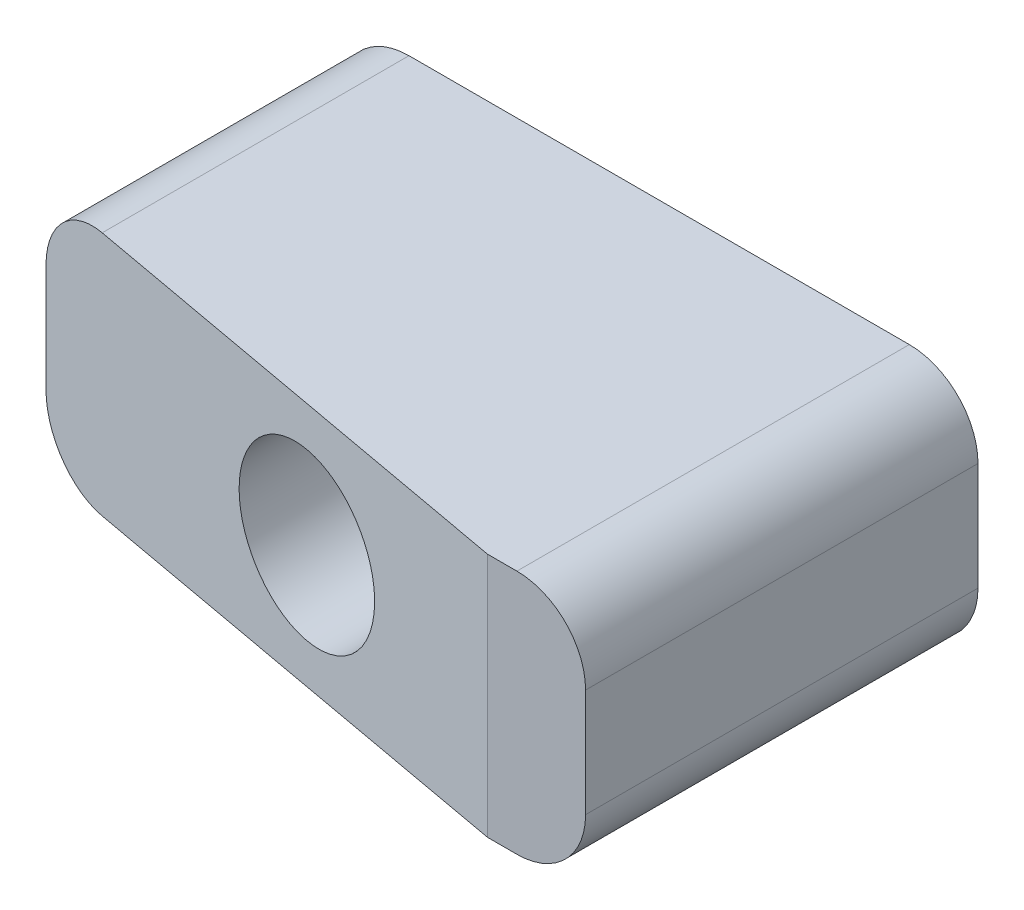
from build123d import *

# Parameters (mm, degrees)
BOSS_EXTRUDE1_DEPTH     = 31.75
CUT_EXTRUDE1_DEPTH      = 1104.819928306
CUT_EXTRUDE1_DEPTH_BACK = 1104.819928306
HOLE1_D                 = 7.1374
HOLE1_CBORE_D           = 10.7188
HOLE1_CBORE_DEPTH       = 19.05
MOVE_FACE1_BY           = 6.35


with BuildPart() as part:
    # Sketch1 → Boss-Extrude1 (new body)
    with BuildSketch(Plane.XY):
        with BuildLine():
            Line((-1066.419, 81.28), (-1098.804, 81.28))
            ThreePointArc((-1098.804, 81.28), (-1101.947089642, 79.978089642), (-1103.249, 76.835))
            Line((-1103.249, 76.835), (-1103.249, 69.85))
            ThreePointArc((-1103.249, 69.85), (-1101.947089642, 66.706910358), (-1098.804, 65.405))
            Line((-1098.804, 65.405), (-1066.419, 65.405))
            ThreePointArc((-1066.419, 65.405), (-1063.275910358, 66.706910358), (-1061.974, 69.85))
            Line((-1061.974, 69.85), (-1061.974, 76.835))
            ThreePointArc((-1061.974, 76.835), (-1063.275910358, 79.978089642), (-1066.419, 81.28))
        make_face()
    extrude(amount=-BOSS_EXTRUDE1_DEPTH)

    # Sketch2 → Cut-Extrude1 (cut, two sides: drawn at the far end of the back side and taken through both)
    with BuildSketch(Plane.XZ.offset(-65.405).offset(-CUT_EXTRUDE1_DEPTH_BACK)):
        Polygon((-963.120223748, 19.127959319), (-1068.324, 0), (-1103.249, -6.35), (-1208.452776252, -25.477959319), (-1246.708694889, 184.929593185), (-1001.376142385, 229.535511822), align=None)
    extrude(amount=CUT_EXTRUDE1_DEPTH + CUT_EXTRUDE1_DEPTH_BACK, mode=Mode.SUBTRACT)

    # Hole1 (through all)
    with Locations(Plane(origin=(-1095.480607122, 74.277499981, 0), x_dir=(1, 0, 0), z_dir=(0, 0, 1))):
        with Locations((12.869107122, -0.934999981)):
            CounterBoreHole(HOLE1_D / 2, HOLE1_CBORE_D / 2, HOLE1_CBORE_DEPTH)

    # Move Face1: a face moved inward by 6.35
    extrude(part.faces().sort_by_distance((-1082.6115, 69.37375, -31.75))[0], amount=MOVE_FACE1_BY, dir=(0, 0, 1), mode=Mode.SUBTRACT)


solid = part.part
